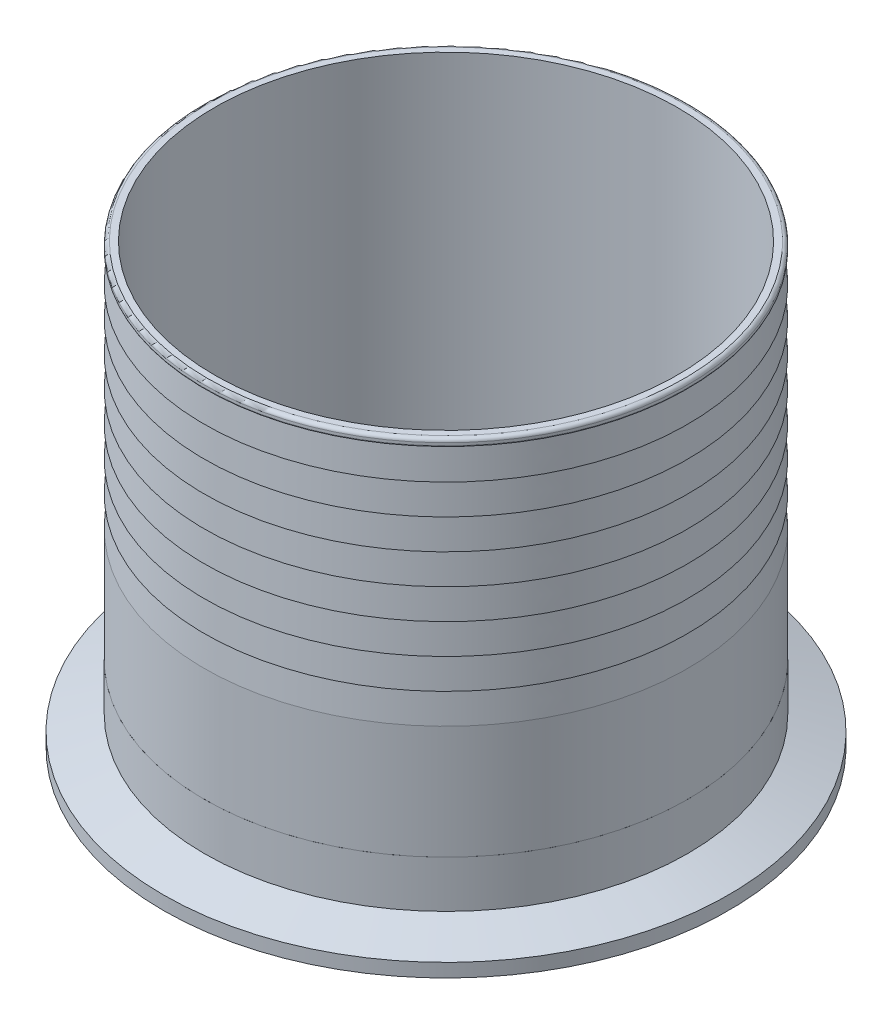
ISO-10303-21;
HEADER;
FILE_DESCRIPTION(('STEP AP214'),'2;1');
FILE_NAME('part.step','',(''),(''),'','','');
FILE_SCHEMA(('AUTOMOTIVE_DESIGN { 1 0 10303 214 1 1 1 1 }'));
ENDSEC;
DATA;
#1=APPLICATION_CONTEXT('core data for automotive mechanical design processes');
#2=APPLICATION_PROTOCOL_DEFINITION('international standard','automotive_design',2000,#1);
#3=PRODUCT_CONTEXT('',#1,'mechanical');
#4=PRODUCT('Part','Part','',(#3));
#5=PRODUCT_RELATED_PRODUCT_CATEGORY('part','',(#4));
#6=PRODUCT_DEFINITION_FORMATION('','',#4);
#7=PRODUCT_DEFINITION_CONTEXT('part definition',#1,'design');
#8=PRODUCT_DEFINITION('design','',#6,#7);
#9=PRODUCT_DEFINITION_SHAPE('','',#8);
#10=(LENGTH_UNIT() NAMED_UNIT(*) SI_UNIT(.MILLI.,.METRE.));
#11=(NAMED_UNIT(*) PLANE_ANGLE_UNIT() SI_UNIT($,.RADIAN.));
#12=(NAMED_UNIT(*) SI_UNIT($,.STERADIAN.) SOLID_ANGLE_UNIT());
#13=UNCERTAINTY_MEASURE_WITH_UNIT(LENGTH_MEASURE(1.E-05),#10,'distance_accuracy_value','');
#14=(GEOMETRIC_REPRESENTATION_CONTEXT(3) GLOBAL_UNCERTAINTY_ASSIGNED_CONTEXT((#13)) GLOBAL_UNIT_ASSIGNED_CONTEXT((#10,
#11,#12)) REPRESENTATION_CONTEXT('',''));
#15=CARTESIAN_POINT('',(0.,0.,0.));
#16=DIRECTION('',(0.,0.,1.));
#17=DIRECTION('',(1.,0.,0.));
#18=AXIS2_PLACEMENT_3D('',#15,#16,#17);
#19=CARTESIAN_POINT('',(31.9768292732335,69.5188429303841,47.1580409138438));
#20=DIRECTION('',(0.,-1.,0.));
#21=DIRECTION('',(-0.956939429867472,0.,0.290287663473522));
#22=AXIS2_PLACEMENT_3D('',#19,#20,#21);
#23=PLANE('',#22);
#24=CARTESIAN_POINT('',(46.7234425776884,69.5188429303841,95.7705639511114));
#25=DIRECTION('',(0.,-1.,0.));
#26=DIRECTION('',(-0.956939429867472,0.,0.290287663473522));
#27=AXIS2_PLACEMENT_3D('',#24,#25,#26);
#28=CIRCLE('',#27,48.6918);
#29=CARTESIAN_POINT('',(0.128339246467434,69.5188429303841,109.905192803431));
#30=VERTEX_POINT('',#29);
#31=EDGE_CURVE('P0_E85',#30,#30,#28,.T.);
#32=ORIENTED_EDGE('',*,*,#31,.F.);
#33=EDGE_LOOP('',(#32));
#34=FACE_BOUND('',#33,.T.);
#35=CARTESIAN_POINT('',(46.7234425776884,69.5188429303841,95.7705639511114));
#36=DIRECTION('',(0.,-1.,0.));
#37=DIRECTION('',(-0.956939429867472,0.,0.290287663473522));
#38=AXIS2_PLACEMENT_3D('',#35,#36,#37);
#39=CIRCLE('',#38,50.8);
#40=CARTESIAN_POINT('',(-1.88908045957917,69.5188429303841,110.517177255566));
#41=VERTEX_POINT('',#40);
#42=EDGE_CURVE('P0_E9',#41,#41,#39,.T.);
#43=ORIENTED_EDGE('',*,*,#42,.T.);
#44=EDGE_LOOP('',(#43));
#45=FACE_BOUND('',#44,.T.);
#46=ADVANCED_FACE('P0_F14',(#34,#45),#23,.T.);
#47=CARTESIAN_POINT('',(46.7234425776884,69.5188429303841,95.7705639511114));
#48=DIRECTION('',(0.,-1.,0.));
#49=DIRECTION('',(-0.956939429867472,0.,0.290287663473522));
#50=AXIS2_PLACEMENT_3D('',#47,#48,#49);
#51=CYLINDRICAL_SURFACE('',#50,50.8);
#52=CARTESIAN_POINT('',(46.7234425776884,93.3440429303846,95.7705639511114));
#53=DIRECTION('',(0.,-1.,0.));
#54=DIRECTION('',(-0.956939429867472,0.,0.290287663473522));
#55=AXIS2_PLACEMENT_3D('',#52,#53,#54);
#56=CIRCLE('',#55,50.8);
#57=CARTESIAN_POINT('',(-1.88908045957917,93.3440429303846,110.517177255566));
#58=VERTEX_POINT('',#57);
#59=EDGE_CURVE('P0_E20',#58,#58,#56,.T.);
#60=ORIENTED_EDGE('',*,*,#59,.T.);
#61=EDGE_LOOP('',(#60));
#62=FACE_BOUND('',#61,.T.);
#63=ORIENTED_EDGE('',*,*,#42,.F.);
#64=EDGE_LOOP('',(#63));
#65=FACE_BOUND('',#64,.T.);
#66=ADVANCED_FACE('P0_F101',(#62,#65),#51,.T.);
#67=CARTESIAN_POINT('',(46.7234425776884,93.3440429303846,95.7705639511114));
#68=DIRECTION('',(0.,-1.,0.));
#69=DIRECTION('',(-0.956939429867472,0.,0.290287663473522));
#70=AXIS2_PLACEMENT_3D('',#67,#68,#69);
#71=CONICAL_SURFACE('',#70,50.8,0.0599281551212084);
#72=CARTESIAN_POINT('',(46.7234425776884,99.6940429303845,95.7705639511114));
#73=DIRECTION('',(0.,-1.,0.));
#74=DIRECTION('',(-0.956939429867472,0.,0.290287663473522));
#75=AXIS2_PLACEMENT_3D('',#72,#73,#74);
#76=CIRCLE('',#75,50.419);
#77=CARTESIAN_POINT('',(-1.52448653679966,99.6940429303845,110.406577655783));
#78=VERTEX_POINT('',#77);
#79=EDGE_CURVE('P0_E24',#78,#78,#76,.T.);
#80=ORIENTED_EDGE('',*,*,#79,.T.);
#81=EDGE_LOOP('',(#80));
#82=FACE_BOUND('',#81,.T.);
#83=ORIENTED_EDGE('',*,*,#59,.F.);
#84=EDGE_LOOP('',(#83));
#85=FACE_BOUND('',#84,.T.);
#86=ADVANCED_FACE('P0_F106',(#82,#85),#71,.T.);
#87=CARTESIAN_POINT('',(31.9768292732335,99.6940429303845,47.1580409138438));
#88=DIRECTION('',(0.,-1.,0.));
#89=DIRECTION('',(-0.956939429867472,0.,0.290287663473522));
#90=AXIS2_PLACEMENT_3D('',#87,#88,#89);
#91=PLANE('',#90);
#92=CARTESIAN_POINT('',(46.7234425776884,99.6940429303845,95.7705639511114));
#93=DIRECTION('',(0.,-1.,0.));
#94=DIRECTION('',(-0.956939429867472,0.,0.290287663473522));
#95=AXIS2_PLACEMENT_3D('',#92,#93,#94);
#96=CIRCLE('',#95,50.8);
#97=CARTESIAN_POINT('',(-1.88908045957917,99.6940429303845,110.517177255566));
#98=VERTEX_POINT('',#97);
#99=EDGE_CURVE('P0_E28',#98,#98,#96,.T.);
#100=ORIENTED_EDGE('',*,*,#99,.T.);
#101=EDGE_LOOP('',(#100));
#102=FACE_BOUND('',#101,.T.);
#103=ORIENTED_EDGE('',*,*,#79,.F.);
#104=EDGE_LOOP('',(#103));
#105=FACE_BOUND('',#104,.T.);
#106=ADVANCED_FACE('P0_F110',(#102,#105),#91,.T.);
#107=CARTESIAN_POINT('',(46.7234425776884,99.6940429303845,95.7705639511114));
#108=DIRECTION('',(0.,-1.,0.));
#109=DIRECTION('',(-0.956939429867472,0.,0.290287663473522));
#110=AXIS2_PLACEMENT_3D('',#107,#108,#109);
#111=CONICAL_SURFACE('',#110,50.8,0.0599281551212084);
#112=CARTESIAN_POINT('',(46.7234425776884,106.044042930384,95.7705639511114));
#113=DIRECTION('',(0.,-1.,0.));
#114=DIRECTION('',(-0.956939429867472,0.,0.290287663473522));
#115=AXIS2_PLACEMENT_3D('',#112,#113,#114);
#116=CIRCLE('',#115,50.419);
#117=CARTESIAN_POINT('',(-1.52448653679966,106.044042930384,110.406577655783));
#118=VERTEX_POINT('',#117);
#119=EDGE_CURVE('P0_E33',#118,#118,#116,.T.);
#120=ORIENTED_EDGE('',*,*,#119,.T.);
#121=EDGE_LOOP('',(#120));
#122=FACE_BOUND('',#121,.T.);
#123=ORIENTED_EDGE('',*,*,#99,.F.);
#124=EDGE_LOOP('',(#123));
#125=FACE_BOUND('',#124,.T.);
#126=ADVANCED_FACE('P0_F117',(#122,#125),#111,.T.);
#127=CARTESIAN_POINT('',(31.9768292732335,106.044042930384,47.1580409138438));
#128=DIRECTION('',(0.,-1.,0.));
#129=DIRECTION('',(-0.956939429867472,0.,0.290287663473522));
#130=AXIS2_PLACEMENT_3D('',#127,#128,#129);
#131=PLANE('',#130);
#132=CARTESIAN_POINT('',(46.7234425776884,106.044042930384,95.7705639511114));
#133=DIRECTION('',(0.,-1.,0.));
#134=DIRECTION('',(-0.956939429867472,0.,0.290287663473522));
#135=AXIS2_PLACEMENT_3D('',#132,#133,#134);
#136=CIRCLE('',#135,50.8);
#137=CARTESIAN_POINT('',(-1.88908045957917,106.044042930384,110.517177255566));
#138=VERTEX_POINT('',#137);
#139=EDGE_CURVE('P0_E36',#138,#138,#136,.T.);
#140=ORIENTED_EDGE('',*,*,#139,.T.);
#141=EDGE_LOOP('',(#140));
#142=FACE_BOUND('',#141,.T.);
#143=ORIENTED_EDGE('',*,*,#119,.F.);
#144=EDGE_LOOP('',(#143));
#145=FACE_BOUND('',#144,.T.);
#146=ADVANCED_FACE('P0_F121',(#142,#145),#131,.T.);
#147=CARTESIAN_POINT('',(46.7234425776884,106.044042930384,95.7705639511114));
#148=DIRECTION('',(0.,-1.,0.));
#149=DIRECTION('',(-0.956939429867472,0.,0.290287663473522));
#150=AXIS2_PLACEMENT_3D('',#147,#148,#149);
#151=CONICAL_SURFACE('',#150,50.8,0.0599281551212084);
#152=CARTESIAN_POINT('',(46.7234425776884,112.394042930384,95.7705639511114));
#153=DIRECTION('',(0.,-1.,0.));
#154=DIRECTION('',(-0.956939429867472,0.,0.290287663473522));
#155=AXIS2_PLACEMENT_3D('',#152,#153,#154);
#156=CIRCLE('',#155,50.419);
#157=CARTESIAN_POINT('',(-1.52448653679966,112.394042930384,110.406577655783));
#158=VERTEX_POINT('',#157);
#159=EDGE_CURVE('P0_E39',#158,#158,#156,.T.);
#160=ORIENTED_EDGE('',*,*,#159,.T.);
#161=EDGE_LOOP('',(#160));
#162=FACE_BOUND('',#161,.T.);
#163=ORIENTED_EDGE('',*,*,#139,.F.);
#164=EDGE_LOOP('',(#163));
#165=FACE_BOUND('',#164,.T.);
#166=ADVANCED_FACE('P0_F125',(#162,#165),#151,.T.);
#167=CARTESIAN_POINT('',(31.9768292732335,112.394042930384,47.1580409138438));
#168=DIRECTION('',(0.,-1.,0.));
#169=DIRECTION('',(-0.956939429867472,0.,0.290287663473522));
#170=AXIS2_PLACEMENT_3D('',#167,#168,#169);
#171=PLANE('',#170);
#172=CARTESIAN_POINT('',(46.7234425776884,112.394042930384,95.7705639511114));
#173=DIRECTION('',(0.,-1.,0.));
#174=DIRECTION('',(-0.956939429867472,0.,0.290287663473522));
#175=AXIS2_PLACEMENT_3D('',#172,#173,#174);
#176=CIRCLE('',#175,50.8);
#177=CARTESIAN_POINT('',(-1.88908045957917,112.394042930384,110.517177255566));
#178=VERTEX_POINT('',#177);
#179=EDGE_CURVE('P0_E42',#178,#178,#176,.T.);
#180=ORIENTED_EDGE('',*,*,#179,.T.);
#181=EDGE_LOOP('',(#180));
#182=FACE_BOUND('',#181,.T.);
#183=ORIENTED_EDGE('',*,*,#159,.F.);
#184=EDGE_LOOP('',(#183));
#185=FACE_BOUND('',#184,.T.);
#186=ADVANCED_FACE('P0_F129',(#182,#185),#171,.T.);
#187=CARTESIAN_POINT('',(46.7234425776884,112.394042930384,95.7705639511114));
#188=DIRECTION('',(0.,-1.,0.));
#189=DIRECTION('',(-0.956939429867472,0.,0.290287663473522));
#190=AXIS2_PLACEMENT_3D('',#187,#188,#189);
#191=CONICAL_SURFACE('',#190,50.8,0.0599281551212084);
#192=CARTESIAN_POINT('',(46.7234425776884,118.744042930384,95.7705639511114));
#193=DIRECTION('',(0.,-1.,0.));
#194=DIRECTION('',(-0.956939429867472,0.,0.290287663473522));
#195=AXIS2_PLACEMENT_3D('',#192,#193,#194);
#196=CIRCLE('',#195,50.419);
#197=CARTESIAN_POINT('',(-1.52448653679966,118.744042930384,110.406577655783));
#198=VERTEX_POINT('',#197);
#199=EDGE_CURVE('P0_E45',#198,#198,#196,.T.);
#200=ORIENTED_EDGE('',*,*,#199,.T.);
#201=EDGE_LOOP('',(#200));
#202=FACE_BOUND('',#201,.T.);
#203=ORIENTED_EDGE('',*,*,#179,.F.);
#204=EDGE_LOOP('',(#203));
#205=FACE_BOUND('',#204,.T.);
#206=ADVANCED_FACE('P0_F133',(#202,#205),#191,.T.);
#207=CARTESIAN_POINT('',(31.9768292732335,118.744042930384,47.1580409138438));
#208=DIRECTION('',(0.,-1.,0.));
#209=DIRECTION('',(-0.956939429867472,0.,0.290287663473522));
#210=AXIS2_PLACEMENT_3D('',#207,#208,#209);
#211=PLANE('',#210);
#212=CARTESIAN_POINT('',(46.7234425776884,118.744042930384,95.7705639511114));
#213=DIRECTION('',(0.,-1.,0.));
#214=DIRECTION('',(-0.956939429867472,0.,0.290287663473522));
#215=AXIS2_PLACEMENT_3D('',#212,#213,#214);
#216=CIRCLE('',#215,50.8);
#217=CARTESIAN_POINT('',(-1.88908045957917,118.744042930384,110.517177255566));
#218=VERTEX_POINT('',#217);
#219=EDGE_CURVE('P0_E48',#218,#218,#216,.T.);
#220=ORIENTED_EDGE('',*,*,#219,.T.);
#221=EDGE_LOOP('',(#220));
#222=FACE_BOUND('',#221,.T.);
#223=ORIENTED_EDGE('',*,*,#199,.F.);
#224=EDGE_LOOP('',(#223));
#225=FACE_BOUND('',#224,.T.);
#226=ADVANCED_FACE('P0_F137',(#222,#225),#211,.T.);
#227=CARTESIAN_POINT('',(46.7234425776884,118.744042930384,95.7705639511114));
#228=DIRECTION('',(0.,-1.,0.));
#229=DIRECTION('',(-0.956939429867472,0.,0.290287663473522));
#230=AXIS2_PLACEMENT_3D('',#227,#228,#229);
#231=CONICAL_SURFACE('',#230,50.8,0.0599281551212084);
#232=CARTESIAN_POINT('',(46.7234425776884,125.094042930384,95.7705639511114));
#233=DIRECTION('',(0.,-1.,0.));
#234=DIRECTION('',(-0.956939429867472,0.,0.290287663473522));
#235=AXIS2_PLACEMENT_3D('',#232,#233,#234);
#236=CIRCLE('',#235,50.419);
#237=CARTESIAN_POINT('',(-1.52448653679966,125.094042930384,110.406577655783));
#238=VERTEX_POINT('',#237);
#239=EDGE_CURVE('P0_E51',#238,#238,#236,.T.);
#240=ORIENTED_EDGE('',*,*,#239,.T.);
#241=EDGE_LOOP('',(#240));
#242=FACE_BOUND('',#241,.T.);
#243=ORIENTED_EDGE('',*,*,#219,.F.);
#244=EDGE_LOOP('',(#243));
#245=FACE_BOUND('',#244,.T.);
#246=ADVANCED_FACE('P0_F141',(#242,#245),#231,.T.);
#247=CARTESIAN_POINT('',(31.9768292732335,125.094042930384,47.1580409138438));
#248=DIRECTION('',(0.,-1.,0.));
#249=DIRECTION('',(-0.956939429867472,0.,0.290287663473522));
#250=AXIS2_PLACEMENT_3D('',#247,#248,#249);
#251=PLANE('',#250);
#252=CARTESIAN_POINT('',(46.7234425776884,125.094042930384,95.7705639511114));
#253=DIRECTION('',(0.,-1.,0.));
#254=DIRECTION('',(-0.956939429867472,0.,0.290287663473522));
#255=AXIS2_PLACEMENT_3D('',#252,#253,#254);
#256=CIRCLE('',#255,50.8);
#257=CARTESIAN_POINT('',(-1.88908045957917,125.094042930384,110.517177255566));
#258=VERTEX_POINT('',#257);
#259=EDGE_CURVE('P0_E54',#258,#258,#256,.T.);
#260=ORIENTED_EDGE('',*,*,#259,.T.);
#261=EDGE_LOOP('',(#260));
#262=FACE_BOUND('',#261,.T.);
#263=ORIENTED_EDGE('',*,*,#239,.F.);
#264=EDGE_LOOP('',(#263));
#265=FACE_BOUND('',#264,.T.);
#266=ADVANCED_FACE('P0_F145',(#262,#265),#251,.T.);
#267=CARTESIAN_POINT('',(46.7234425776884,125.094042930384,95.7705639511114));
#268=DIRECTION('',(0.,-1.,0.));
#269=DIRECTION('',(-0.956939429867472,0.,0.290287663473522));
#270=AXIS2_PLACEMENT_3D('',#267,#268,#269);
#271=CONICAL_SURFACE('',#270,50.8,0.0599281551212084);
#272=CARTESIAN_POINT('',(46.7234425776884,131.444042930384,95.7705639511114));
#273=DIRECTION('',(0.,-1.,0.));
#274=DIRECTION('',(-0.956939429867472,0.,0.290287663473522));
#275=AXIS2_PLACEMENT_3D('',#272,#273,#274);
#276=CIRCLE('',#275,50.419);
#277=CARTESIAN_POINT('',(-1.52448653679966,131.444042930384,110.406577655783));
#278=VERTEX_POINT('',#277);
#279=EDGE_CURVE('P0_E57',#278,#278,#276,.T.);
#280=ORIENTED_EDGE('',*,*,#279,.T.);
#281=EDGE_LOOP('',(#280));
#282=FACE_BOUND('',#281,.T.);
#283=ORIENTED_EDGE('',*,*,#259,.F.);
#284=EDGE_LOOP('',(#283));
#285=FACE_BOUND('',#284,.T.);
#286=ADVANCED_FACE('P0_F149',(#282,#285),#271,.T.);
#287=CARTESIAN_POINT('',(31.9768292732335,131.444042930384,47.1580409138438));
#288=DIRECTION('',(0.,-1.,0.));
#289=DIRECTION('',(-0.956939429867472,0.,0.290287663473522));
#290=AXIS2_PLACEMENT_3D('',#287,#288,#289);
#291=PLANE('',#290);
#292=CARTESIAN_POINT('',(46.7234425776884,131.444042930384,95.7705639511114));
#293=DIRECTION('',(0.,-1.,0.));
#294=DIRECTION('',(-0.956939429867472,0.,0.290287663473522));
#295=AXIS2_PLACEMENT_3D('',#292,#293,#294);
#296=CIRCLE('',#295,50.8);
#297=CARTESIAN_POINT('',(-1.88908045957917,131.444042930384,110.517177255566));
#298=VERTEX_POINT('',#297);
#299=EDGE_CURVE('P0_E60',#298,#298,#296,.T.);
#300=ORIENTED_EDGE('',*,*,#299,.T.);
#301=EDGE_LOOP('',(#300));
#302=FACE_BOUND('',#301,.T.);
#303=ORIENTED_EDGE('',*,*,#279,.F.);
#304=EDGE_LOOP('',(#303));
#305=FACE_BOUND('',#304,.T.);
#306=ADVANCED_FACE('P0_F153',(#302,#305),#291,.T.);
#307=CARTESIAN_POINT('',(46.7234425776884,131.444042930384,95.7705639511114));
#308=DIRECTION('',(0.,-1.,0.));
#309=DIRECTION('',(-0.956939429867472,0.,0.290287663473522));
#310=AXIS2_PLACEMENT_3D('',#307,#308,#309);
#311=CONICAL_SURFACE('',#310,50.8,0.0599281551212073);
#312=CARTESIAN_POINT('',(46.7234425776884,137.794042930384,95.7705639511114));
#313=DIRECTION('',(0.,-1.,0.));
#314=DIRECTION('',(-0.956939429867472,0.,0.290287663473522));
#315=AXIS2_PLACEMENT_3D('',#312,#313,#314);
#316=CIRCLE('',#315,50.419);
#317=CARTESIAN_POINT('',(-1.52448653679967,137.794042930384,110.406577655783));
#318=VERTEX_POINT('',#317);
#319=EDGE_CURVE('P0_E63',#318,#318,#316,.T.);
#320=ORIENTED_EDGE('',*,*,#319,.T.);
#321=EDGE_LOOP('',(#320));
#322=FACE_BOUND('',#321,.T.);
#323=ORIENTED_EDGE('',*,*,#299,.F.);
#324=EDGE_LOOP('',(#323));
#325=FACE_BOUND('',#324,.T.);
#326=ADVANCED_FACE('P0_F157',(#322,#325),#311,.T.);
#327=CARTESIAN_POINT('',(31.9768292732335,137.794042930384,47.1580409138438));
#328=DIRECTION('',(0.,-1.,0.));
#329=DIRECTION('',(-0.956939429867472,0.,0.290287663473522));
#330=AXIS2_PLACEMENT_3D('',#327,#328,#329);
#331=PLANE('',#330);
#332=CARTESIAN_POINT('',(46.7234425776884,137.794042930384,95.7705639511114));
#333=DIRECTION('',(0.,-1.,0.));
#334=DIRECTION('',(-0.956939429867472,0.,0.290287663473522));
#335=AXIS2_PLACEMENT_3D('',#332,#333,#334);
#336=CIRCLE('',#335,50.8);
#337=CARTESIAN_POINT('',(-1.88908045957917,137.794042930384,110.517177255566));
#338=VERTEX_POINT('',#337);
#339=EDGE_CURVE('P0_E66',#338,#338,#336,.T.);
#340=ORIENTED_EDGE('',*,*,#339,.T.);
#341=EDGE_LOOP('',(#340));
#342=FACE_BOUND('',#341,.T.);
#343=ORIENTED_EDGE('',*,*,#319,.F.);
#344=EDGE_LOOP('',(#343));
#345=FACE_BOUND('',#344,.T.);
#346=ADVANCED_FACE('P0_F161',(#342,#345),#331,.T.);
#347=CARTESIAN_POINT('',(46.7234425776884,137.794042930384,95.7705639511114));
#348=DIRECTION('',(0.,-1.,0.));
#349=DIRECTION('',(-0.956939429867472,0.,0.290287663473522));
#350=AXIS2_PLACEMENT_3D('',#347,#348,#349);
#351=CONICAL_SURFACE('',#350,50.8,0.0599281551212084);
#352=CARTESIAN_POINT('',(46.7234425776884,144.144042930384,95.7705639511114));
#353=DIRECTION('',(0.,-1.,0.));
#354=DIRECTION('',(-0.956939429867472,0.,0.290287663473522));
#355=AXIS2_PLACEMENT_3D('',#352,#353,#354);
#356=CIRCLE('',#355,50.419);
#357=CARTESIAN_POINT('',(-1.52448653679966,144.144042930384,110.406577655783));
#358=VERTEX_POINT('',#357);
#359=EDGE_CURVE('P0_E69',#358,#358,#356,.T.);
#360=ORIENTED_EDGE('',*,*,#359,.T.);
#361=EDGE_LOOP('',(#360));
#362=FACE_BOUND('',#361,.T.);
#363=ORIENTED_EDGE('',*,*,#339,.F.);
#364=EDGE_LOOP('',(#363));
#365=FACE_BOUND('',#364,.T.);
#366=ADVANCED_FACE('P0_F165',(#362,#365),#351,.T.);
#367=CARTESIAN_POINT('',(32.0505623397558,144.144042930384,47.40110352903));
#368=DIRECTION('',(0.,-1.,0.));
#369=DIRECTION('',(-0.956939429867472,0.,0.290287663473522));
#370=AXIS2_PLACEMENT_3D('',#367,#368,#369);
#371=PLANE('',#370);
#372=CARTESIAN_POINT('',(46.7234425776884,144.144042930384,95.7705639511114));
#373=DIRECTION('',(0.,-1.,0.));
#374=DIRECTION('',(-0.956939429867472,0.,0.290287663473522));
#375=AXIS2_PLACEMENT_3D('',#372,#373,#374);
#376=CIRCLE('',#375,50.5460000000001);
#377=CARTESIAN_POINT('',(-1.64601784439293,144.144042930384,110.443444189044));
#378=VERTEX_POINT('',#377);
#379=EDGE_CURVE('P0_E72',#378,#378,#376,.T.);
#380=ORIENTED_EDGE('',*,*,#379,.T.);
#381=EDGE_LOOP('',(#380));
#382=FACE_BOUND('',#381,.T.);
#383=ORIENTED_EDGE('',*,*,#359,.F.);
#384=EDGE_LOOP('',(#383));
#385=FACE_BOUND('',#384,.T.);
#386=ADVANCED_FACE('P0_F169',(#382,#385),#371,.T.);
#387=CARTESIAN_POINT('',(46.7234425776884,144.398042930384,95.7705639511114));
#388=DIRECTION('',(0.,-1.,0.));
#389=DIRECTION('',(-0.956939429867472,0.,0.290287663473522));
#390=AXIS2_PLACEMENT_3D('',#387,#388,#389);
#391=TOROIDAL_SURFACE('',#390,50.546,0.25400000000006);
#392=CARTESIAN_POINT('',(46.7234425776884,144.398042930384,95.7705639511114));
#393=DIRECTION('',(0.,-1.,0.));
#394=DIRECTION('',(-0.956939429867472,0.,0.290287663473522));
#395=AXIS2_PLACEMENT_3D('',#392,#393,#394);
#396=CIRCLE('',#395,50.8);
#397=CARTESIAN_POINT('',(-1.88908045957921,144.398042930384,110.517177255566));
#398=VERTEX_POINT('',#397);
#399=EDGE_CURVE('P0_E75',#398,#398,#396,.T.);
#400=ORIENTED_EDGE('',*,*,#399,.T.);
#401=EDGE_LOOP('',(#400));
#402=FACE_BOUND('',#401,.T.);
#403=ORIENTED_EDGE('',*,*,#379,.F.);
#404=EDGE_LOOP('',(#403));
#405=FACE_BOUND('',#404,.T.);
#406=ADVANCED_FACE('P0_F173',(#402,#405),#391,.T.);
#407=CARTESIAN_POINT('',(46.7234425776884,69.5188429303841,95.7705639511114));
#408=DIRECTION('',(0.,-1.,0.));
#409=DIRECTION('',(-0.956939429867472,0.,0.290287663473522));
#410=AXIS2_PLACEMENT_3D('',#407,#408,#409);
#411=CYLINDRICAL_SURFACE('',#410,50.8);
#412=CARTESIAN_POINT('',(46.7234425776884,144.956842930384,95.7705639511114));
#413=DIRECTION('',(0.,-1.,0.));
#414=DIRECTION('',(-0.956939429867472,0.,0.290287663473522));
#415=AXIS2_PLACEMENT_3D('',#412,#413,#414);
#416=CIRCLE('',#415,50.8);
#417=CARTESIAN_POINT('',(-1.88908045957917,144.956842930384,110.517177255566));
#418=VERTEX_POINT('',#417);
#419=EDGE_CURVE('P0_E78',#418,#418,#416,.T.);
#420=ORIENTED_EDGE('',*,*,#419,.T.);
#421=EDGE_LOOP('',(#420));
#422=FACE_BOUND('',#421,.T.);
#423=ORIENTED_EDGE('',*,*,#399,.F.);
#424=EDGE_LOOP('',(#423));
#425=FACE_BOUND('',#424,.T.);
#426=ADVANCED_FACE('P0_F177',(#422,#425),#411,.T.);
#427=CARTESIAN_POINT('',(46.7234425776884,144.956842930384,95.7705639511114));
#428=DIRECTION('',(0.,-1.,0.));
#429=DIRECTION('',(-0.956939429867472,0.,0.290287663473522));
#430=AXIS2_PLACEMENT_3D('',#427,#428,#429);
#431=TOROIDAL_SURFACE('',#430,50.038,0.762000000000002);
#432=CARTESIAN_POINT('',(46.7234425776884,145.718842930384,95.7705639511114));
#433=DIRECTION('',(0.,-1.,0.));
#434=DIRECTION('',(-0.956939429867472,0.,0.290287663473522));
#435=AXIS2_PLACEMENT_3D('',#432,#433,#434);
#436=CIRCLE('',#435,50.038);
#437=CARTESIAN_POINT('',(-1.15989261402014,145.718842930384,110.295978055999));
#438=VERTEX_POINT('',#437);
#439=EDGE_CURVE('P0_E81',#438,#438,#436,.T.);
#440=ORIENTED_EDGE('',*,*,#439,.T.);
#441=EDGE_LOOP('',(#440));
#442=FACE_BOUND('',#441,.T.);
#443=ORIENTED_EDGE('',*,*,#419,.F.);
#444=EDGE_LOOP('',(#443));
#445=FACE_BOUND('',#444,.T.);
#446=ADVANCED_FACE('P0_F181',(#442,#445),#431,.T.);
#447=CARTESIAN_POINT('',(46.7234425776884,145.718842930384,95.7705639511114));
#448=DIRECTION('',(0.,1.,0.));
#449=DIRECTION('',(0.956939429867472,0.,-0.290287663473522));
#450=AXIS2_PLACEMENT_3D('',#447,#448,#449);
#451=PLANE('',#450);
#452=CARTESIAN_POINT('',(46.7234425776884,145.718842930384,95.7705639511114));
#453=DIRECTION('',(0.,-1.,0.));
#454=DIRECTION('',(-0.956939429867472,0.,0.290287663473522));
#455=AXIS2_PLACEMENT_3D('',#452,#453,#454);
#456=CIRCLE('',#455,48.6918);
#457=CARTESIAN_POINT('',(0.128339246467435,145.718842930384,109.905192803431));
#458=VERTEX_POINT('',#457);
#459=EDGE_CURVE('P0_E84',#458,#458,#456,.T.);
#460=ORIENTED_EDGE('',*,*,#459,.T.);
#461=EDGE_LOOP('',(#460));
#462=FACE_BOUND('',#461,.T.);
#463=ORIENTED_EDGE('',*,*,#439,.F.);
#464=EDGE_LOOP('',(#463));
#465=FACE_BOUND('',#464,.T.);
#466=ADVANCED_FACE('P0_F91',(#462,#465),#451,.T.);
#467=CARTESIAN_POINT('',(46.7234425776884,145.718842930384,95.7705639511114));
#468=DIRECTION('',(0.,-1.,0.));
#469=DIRECTION('',(-0.956939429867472,0.,0.290287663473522));
#470=AXIS2_PLACEMENT_3D('',#467,#468,#469);
#471=CYLINDRICAL_SURFACE('',#470,48.6918);
#472=CARTESIAN_POINT('',(0.128339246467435,145.718842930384,109.905192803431));
#473=CARTESIAN_POINT('',(0.128339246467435,144.925092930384,109.905192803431));
#474=CARTESIAN_POINT('',(0.128339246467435,144.131342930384,109.905192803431));
#475=CARTESIAN_POINT('',(0.128339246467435,142.543842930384,109.905192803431));
#476=CARTESIAN_POINT('',(0.128339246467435,141.750092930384,109.905192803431));
#477=CARTESIAN_POINT('',(0.128339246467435,140.162592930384,109.905192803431));
#478=CARTESIAN_POINT('',(0.128339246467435,139.368842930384,109.905192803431));
#479=CARTESIAN_POINT('',(0.128339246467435,137.781342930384,109.905192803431));
#480=CARTESIAN_POINT('',(0.128339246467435,136.987592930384,109.905192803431));
#481=CARTESIAN_POINT('',(0.128339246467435,135.400092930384,109.905192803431));
#482=CARTESIAN_POINT('',(0.128339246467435,134.606342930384,109.905192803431));
#483=CARTESIAN_POINT('',(0.128339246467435,133.018842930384,109.905192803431));
#484=CARTESIAN_POINT('',(0.128339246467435,132.225092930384,109.905192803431));
#485=CARTESIAN_POINT('',(0.128339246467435,130.637592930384,109.905192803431));
#486=CARTESIAN_POINT('',(0.128339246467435,129.843842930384,109.905192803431));
#487=CARTESIAN_POINT('',(0.128339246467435,128.256342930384,109.905192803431));
#488=CARTESIAN_POINT('',(0.128339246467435,127.462592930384,109.905192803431));
#489=CARTESIAN_POINT('',(0.128339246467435,125.875092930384,109.905192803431));
#490=CARTESIAN_POINT('',(0.128339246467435,125.081342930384,109.905192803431));
#491=CARTESIAN_POINT('',(0.128339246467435,123.493842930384,109.905192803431));
#492=CARTESIAN_POINT('',(0.128339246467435,122.700092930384,109.905192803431));
#493=CARTESIAN_POINT('',(0.128339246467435,121.112592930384,109.905192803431));
#494=CARTESIAN_POINT('',(0.128339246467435,120.318842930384,109.905192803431));
#495=CARTESIAN_POINT('',(0.128339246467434,118.731342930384,109.905192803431));
#496=CARTESIAN_POINT('',(0.128339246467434,117.937592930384,109.905192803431));
#497=CARTESIAN_POINT('',(0.128339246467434,116.350092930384,109.905192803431));
#498=CARTESIAN_POINT('',(0.128339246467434,115.556342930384,109.905192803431));
#499=CARTESIAN_POINT('',(0.128339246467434,113.968842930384,109.905192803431));
#500=CARTESIAN_POINT('',(0.128339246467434,113.175092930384,109.905192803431));
#501=CARTESIAN_POINT('',(0.128339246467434,111.587592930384,109.905192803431));
#502=CARTESIAN_POINT('',(0.128339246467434,110.793842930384,109.905192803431));
#503=CARTESIAN_POINT('',(0.128339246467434,109.206342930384,109.905192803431));
#504=CARTESIAN_POINT('',(0.128339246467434,108.412592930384,109.905192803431));
#505=CARTESIAN_POINT('',(0.128339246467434,106.825092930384,109.905192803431));
#506=CARTESIAN_POINT('',(0.128339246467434,106.031342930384,109.905192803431));
#507=CARTESIAN_POINT('',(0.128339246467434,104.443842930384,109.905192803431));
#508=CARTESIAN_POINT('',(0.128339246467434,103.650092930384,109.905192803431));
#509=CARTESIAN_POINT('',(0.128339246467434,102.062592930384,109.905192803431));
#510=CARTESIAN_POINT('',(0.128339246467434,101.268842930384,109.905192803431));
#511=CARTESIAN_POINT('',(0.128339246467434,99.6813429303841,109.905192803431));
#512=CARTESIAN_POINT('',(0.128339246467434,98.8875929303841,109.905192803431));
#513=CARTESIAN_POINT('',(0.128339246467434,97.3000929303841,109.905192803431));
#514=CARTESIAN_POINT('',(0.128339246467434,96.5063429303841,109.905192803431));
#515=CARTESIAN_POINT('',(0.128339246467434,94.9188429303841,109.905192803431));
#516=CARTESIAN_POINT('',(0.128339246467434,94.1250929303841,109.905192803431));
#517=CARTESIAN_POINT('',(0.128339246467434,92.5375929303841,109.905192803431));
#518=CARTESIAN_POINT('',(0.128339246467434,91.7438429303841,109.905192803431));
#519=CARTESIAN_POINT('',(0.128339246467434,90.1563429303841,109.905192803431));
#520=CARTESIAN_POINT('',(0.128339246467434,89.3625929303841,109.905192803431));
#521=CARTESIAN_POINT('',(0.128339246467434,87.7750929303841,109.905192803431));
#522=CARTESIAN_POINT('',(0.128339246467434,86.9813429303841,109.905192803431));
#523=CARTESIAN_POINT('',(0.128339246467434,85.3938429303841,109.905192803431));
#524=CARTESIAN_POINT('',(0.128339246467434,84.6000929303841,109.905192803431));
#525=CARTESIAN_POINT('',(0.128339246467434,83.0125929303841,109.905192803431));
#526=CARTESIAN_POINT('',(0.128339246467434,82.2188429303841,109.905192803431));
#527=CARTESIAN_POINT('',(0.128339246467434,80.6313429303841,109.905192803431));
#528=CARTESIAN_POINT('',(0.128339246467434,79.8375929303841,109.905192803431));
#529=CARTESIAN_POINT('',(0.128339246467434,78.2500929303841,109.905192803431));
#530=CARTESIAN_POINT('',(0.128339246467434,77.4563429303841,109.905192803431));
#531=CARTESIAN_POINT('',(0.128339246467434,75.8688429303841,109.905192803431));
#532=CARTESIAN_POINT('',(0.128339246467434,75.0750929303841,109.905192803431));
#533=CARTESIAN_POINT('',(0.128339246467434,73.4875929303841,109.905192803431));
#534=CARTESIAN_POINT('',(0.128339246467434,72.6938429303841,109.905192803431));
#535=CARTESIAN_POINT('',(0.128339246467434,71.1063429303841,109.905192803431));
#536=CARTESIAN_POINT('',(0.128339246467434,70.3125929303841,109.905192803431));
#537=CARTESIAN_POINT('',(0.128339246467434,69.5188429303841,109.905192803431));
#538=B_SPLINE_CURVE_WITH_KNOTS('',3,(#472,#473,#474,#475,#476,#477,#478,#479,#480,#481,#482,
#483,#484,#485,#486,#487,#488,#489,#490,#491,#492,#493,#494,#495,#496,#497,#498,#499,#500,#501,
#502,#503,#504,#505,#506,#507,#508,#509,#510,#511,#512,#513,#514,#515,#516,#517,#518,#519,#520,
#521,#522,#523,#524,#525,#526,#527,#528,#529,#530,#531,#532,#533,#534,#535,#536,#537),
.UNSPECIFIED.,.F.,.F.,(4,2,2,2,2,2,2,2,2,2,2,2,2,2,2,2,2,2,2,2,2,2,2,2,2,2,2,2,2,2,2,2,4),(0.,
2.38124999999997,4.76249999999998,7.14374999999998,9.52499999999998,11.90625,14.2875,16.66875,
19.05,21.43125,23.8125,26.19375,28.575,30.95625,33.3375,35.71875,38.1,40.48125,42.8625,45.24375,
47.625,50.00625,52.3875,54.76875,57.15,59.53125,61.9125,64.29375,66.675,69.05625,71.4375,
73.81875,76.2),.UNSPECIFIED.);
#539=EDGE_CURVE('P0_BSEAM94',#458,#30,#538,.T.);
#540=ORIENTED_EDGE('',*,*,#459,.F.);
#541=ORIENTED_EDGE('',*,*,#31,.T.);
#542=ORIENTED_EDGE('',*,*,#539,.T.);
#543=ORIENTED_EDGE('',*,*,#539,.F.);
#544=EDGE_LOOP('',(#540,#542,#541,#543));
#545=FACE_BOUND('',#544,.T.);
#546=ADVANCED_FACE('P0_F94',(#545),#471,.F.);
#547=CLOSED_SHELL('',(#46,#66,#86,#106,#126,#146,#166,#186,#206,#226,#246,#266,#286,#306,#326,
#346,#366,#386,#406,#426,#446,#466,#546));
#548=MANIFOLD_SOLID_BREP('P0_B1',#547);
#549=CARTESIAN_POINT('',(46.7234425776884,54.4312429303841,95.7705639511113));
#550=DIRECTION('',(0.,-1.,0.));
#551=DIRECTION('',(0.,0.,-1.));
#552=AXIS2_PLACEMENT_3D('',#549,#550,#551);
#553=TOROIDAL_SURFACE('',#552,56.6185084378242,0.787400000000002);
#554=CARTESIAN_POINT('',(46.7234425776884,53.6438429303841,95.7705639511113));
#555=DIRECTION('',(0.,-1.,0.));
#556=DIRECTION('',(0.,0.,-1.));
#557=AXIS2_PLACEMENT_3D('',#554,#555,#556);
#558=CIRCLE('',#557,56.6185084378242);
#559=CARTESIAN_POINT('',(46.7234425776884,53.6438429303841,39.1520555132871));
#560=VERTEX_POINT('',#559);
#561=EDGE_CURVE('P1_E49',#560,#560,#558,.T.);
#562=ORIENTED_EDGE('',*,*,#561,.T.);
#563=EDGE_LOOP('',(#562));
#564=FACE_BOUND('',#563,.T.);
#565=CARTESIAN_POINT('',(46.7234425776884,54.1183019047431,95.7705639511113));
#566=DIRECTION('',(0.,-1.,0.));
#567=DIRECTION('',(0.,0.,-1.));
#568=AXIS2_PLACEMENT_3D('',#565,#566,#567);
#569=CIRCLE('',#568,55.8959666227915);
#570=CARTESIAN_POINT('',(46.7234425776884,54.1183019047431,39.8745973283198));
#571=VERTEX_POINT('',#570);
#572=EDGE_CURVE('P1_E10',#571,#571,#569,.T.);
#573=ORIENTED_EDGE('',*,*,#572,.F.);
#574=EDGE_LOOP('',(#573));
#575=FACE_BOUND('',#574,.T.);
#576=ADVANCED_FACE('P1_F15',(#564,#575),#553,.T.);
#577=CARTESIAN_POINT('',(46.7234425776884,53.6438429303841,95.7705639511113));
#578=DIRECTION('',(0.,-1.,0.));
#579=DIRECTION('',(0.,0.,-1.));
#580=AXIS2_PLACEMENT_3D('',#577,#578,#579);
#581=TOROIDAL_SURFACE('',#580,54.8005,1.1938);
#582=CARTESIAN_POINT('',(46.7234425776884,54.1183019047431,95.7705639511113));
#583=DIRECTION('',(0.,-1.,0.));
#584=DIRECTION('',(0.,0.,-1.));
#585=AXIS2_PLACEMENT_3D('',#582,#583,#584);
#586=CIRCLE('',#585,53.7050333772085);
#587=CARTESIAN_POINT('',(46.7234425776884,54.1183019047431,42.0655305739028));
#588=VERTEX_POINT('',#587);
#589=EDGE_CURVE('P1_E21',#588,#588,#586,.T.);
#590=ORIENTED_EDGE('',*,*,#589,.F.);
#591=EDGE_LOOP('',(#590));
#592=FACE_BOUND('',#591,.T.);
#593=ORIENTED_EDGE('',*,*,#572,.T.);
#594=EDGE_LOOP('',(#593));
#595=FACE_BOUND('',#594,.T.);
#596=ADVANCED_FACE('P1_F98',(#592,#595),#581,.F.);
#597=CARTESIAN_POINT('',(46.7234425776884,54.4312429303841,95.7705639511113));
#598=DIRECTION('',(0.,-1.,0.));
#599=DIRECTION('',(0.,0.,-1.));
#600=AXIS2_PLACEMENT_3D('',#597,#598,#599);
#601=TOROIDAL_SURFACE('',#600,52.9824915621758,0.787399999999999);
#602=ORIENTED_EDGE('',*,*,#589,.T.);
#603=EDGE_LOOP('',(#602));
#604=FACE_BOUND('',#603,.T.);
#605=CARTESIAN_POINT('',(46.7234425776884,53.6438429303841,95.7705639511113));
#606=DIRECTION('',(0.,-1.,0.));
#607=DIRECTION('',(0.,0.,-1.));
#608=AXIS2_PLACEMENT_3D('',#605,#606,#607);
#609=CIRCLE('',#608,52.9824915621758);
#610=CARTESIAN_POINT('',(46.7234425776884,53.6438429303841,42.7880723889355));
#611=VERTEX_POINT('',#610);
#612=EDGE_CURVE('P1_E25',#611,#611,#609,.T.);
#613=ORIENTED_EDGE('',*,*,#612,.F.);
#614=EDGE_LOOP('',(#613));
#615=FACE_BOUND('',#614,.T.);
#616=ADVANCED_FACE('P1_F94',(#604,#615),#601,.T.);
#617=CARTESIAN_POINT('',(46.7234425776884,53.6438429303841,95.7705639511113));
#618=DIRECTION('',(0.,1.,0.));
#619=DIRECTION('',(0.,0.,1.));
#620=AXIS2_PLACEMENT_3D('',#617,#618,#619);
#621=PLANE('',#620);
#622=CARTESIAN_POINT('',(46.7234425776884,53.6438429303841,95.7705639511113));
#623=DIRECTION('',(0.,-1.,0.));
#624=DIRECTION('',(0.,0.,-1.));
#625=AXIS2_PLACEMENT_3D('',#622,#623,#624);
#626=CIRCLE('',#625,48.6918);
#627=CARTESIAN_POINT('',(46.7234425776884,53.6438429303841,47.0787639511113));
#628=VERTEX_POINT('',#627);
#629=EDGE_CURVE('P1_E29',#628,#628,#626,.T.);
#630=ORIENTED_EDGE('',*,*,#629,.F.);
#631=EDGE_LOOP('',(#630));
#632=FACE_BOUND('',#631,.T.);
#633=ORIENTED_EDGE('',*,*,#612,.T.);
#634=EDGE_LOOP('',(#633));
#635=FACE_BOUND('',#634,.T.);
#636=ADVANCED_FACE('P1_F87',(#632,#635),#621,.F.);
#637=CARTESIAN_POINT('',(46.7234425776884,53.6438429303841,95.7705639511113));
#638=DIRECTION('',(0.,-1.,0.));
#639=DIRECTION('',(0.,0.,-1.));
#640=AXIS2_PLACEMENT_3D('',#637,#638,#639);
#641=CYLINDRICAL_SURFACE('',#640,48.6918);
#642=ORIENTED_EDGE('',*,*,#629,.T.);
#643=EDGE_LOOP('',(#642));
#644=FACE_BOUND('',#643,.T.);
#645=CARTESIAN_POINT('',(46.7234425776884,69.5188429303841,95.7705639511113));
#646=DIRECTION('',(0.,-1.,0.));
#647=DIRECTION('',(0.,0.,-1.));
#648=AXIS2_PLACEMENT_3D('',#645,#646,#647);
#649=CIRCLE('',#648,48.6918);
#650=CARTESIAN_POINT('',(46.7234425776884,69.5188429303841,47.0787639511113));
#651=VERTEX_POINT('',#650);
#652=EDGE_CURVE('P1_E34',#651,#651,#649,.T.);
#653=ORIENTED_EDGE('',*,*,#652,.F.);
#654=EDGE_LOOP('',(#653));
#655=FACE_BOUND('',#654,.T.);
#656=ADVANCED_FACE('P1_F82',(#644,#655),#641,.F.);
#657=CARTESIAN_POINT('',(46.7234425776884,69.5188429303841,95.7705639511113));
#658=DIRECTION('',(0.,-1.,0.));
#659=DIRECTION('',(0.,0.,-1.));
#660=AXIS2_PLACEMENT_3D('',#657,#658,#659);
#661=PLANE('',#660);
#662=CARTESIAN_POINT('',(46.7234425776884,69.5188429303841,95.7705639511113));
#663=DIRECTION('',(0.,-1.,0.));
#664=DIRECTION('',(0.,0.,-1.));
#665=AXIS2_PLACEMENT_3D('',#662,#663,#664);
#666=CIRCLE('',#665,50.8);
#667=CARTESIAN_POINT('',(46.7234425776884,69.5188429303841,44.9705639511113));
#668=VERTEX_POINT('',#667);
#669=EDGE_CURVE('P1_E37',#668,#668,#666,.T.);
#670=ORIENTED_EDGE('',*,*,#669,.F.);
#671=EDGE_LOOP('',(#670));
#672=FACE_BOUND('',#671,.T.);
#673=ORIENTED_EDGE('',*,*,#652,.T.);
#674=EDGE_LOOP('',(#673));
#675=FACE_BOUND('',#674,.T.);
#676=ADVANCED_FACE('P1_F76',(#672,#675),#661,.F.);
#677=CARTESIAN_POINT('',(46.7234425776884,53.6438429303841,95.7705639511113));
#678=DIRECTION('',(0.,-1.,0.));
#679=DIRECTION('',(0.,0.,-1.));
#680=AXIS2_PLACEMENT_3D('',#677,#678,#679);
#681=CYLINDRICAL_SURFACE('',#680,50.8);
#682=CARTESIAN_POINT('',(46.7234425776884,59.6411347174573,95.7705639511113));
#683=DIRECTION('',(0.,-1.,0.));
#684=DIRECTION('',(0.,0.,-1.));
#685=AXIS2_PLACEMENT_3D('',#682,#683,#684);
#686=CIRCLE('',#685,50.8);
#687=CARTESIAN_POINT('',(46.7234425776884,59.6411347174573,44.9705639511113));
#688=VERTEX_POINT('',#687);
#689=EDGE_CURVE('P1_E40',#688,#688,#686,.T.);
#690=ORIENTED_EDGE('',*,*,#689,.F.);
#691=EDGE_LOOP('',(#690));
#692=FACE_BOUND('',#691,.T.);
#693=ORIENTED_EDGE('',*,*,#669,.T.);
#694=EDGE_LOOP('',(#693));
#695=FACE_BOUND('',#694,.T.);
#696=ADVANCED_FACE('P1_F70',(#692,#695),#681,.T.);
#697=CARTESIAN_POINT('',(46.7234425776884,59.6411347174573,95.7705639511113));
#698=DIRECTION('',(0.,-1.,0.));
#699=DIRECTION('',(0.,0.,-1.));
#700=AXIS2_PLACEMENT_3D('',#697,#698,#699);
#701=CONICAL_SURFACE('',#700,50.8,1.22173047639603);
#702=CARTESIAN_POINT('',(46.7234425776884,56.4886429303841,95.7705639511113));
#703=DIRECTION('',(0.,-1.,0.));
#704=DIRECTION('',(0.,0.,-1.));
#705=AXIS2_PLACEMENT_3D('',#702,#703,#704);
#706=CIRCLE('',#705,59.4614);
#707=CARTESIAN_POINT('',(46.7234425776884,56.4886429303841,36.3091639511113));
#708=VERTEX_POINT('',#707);
#709=EDGE_CURVE('P1_E43',#708,#708,#706,.T.);
#710=ORIENTED_EDGE('',*,*,#709,.F.);
#711=EDGE_LOOP('',(#710));
#712=FACE_BOUND('',#711,.T.);
#713=ORIENTED_EDGE('',*,*,#689,.T.);
#714=EDGE_LOOP('',(#713));
#715=FACE_BOUND('',#714,.T.);
#716=ADVANCED_FACE('P1_F64',(#712,#715),#701,.T.);
#717=CARTESIAN_POINT('',(46.7234425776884,53.6438429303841,95.7705639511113));
#718=DIRECTION('',(0.,-1.,0.));
#719=DIRECTION('',(0.,0.,-1.));
#720=AXIS2_PLACEMENT_3D('',#717,#718,#719);
#721=CYLINDRICAL_SURFACE('',#720,59.4614);
#722=CARTESIAN_POINT('',(46.7234425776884,53.6438429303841,95.7705639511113));
#723=DIRECTION('',(0.,-1.,0.));
#724=DIRECTION('',(0.,0.,-1.));
#725=AXIS2_PLACEMENT_3D('',#722,#723,#724);
#726=CIRCLE('',#725,59.4614);
#727=CARTESIAN_POINT('',(46.7234425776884,53.6438429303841,36.3091639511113));
#728=VERTEX_POINT('',#727);
#729=EDGE_CURVE('P1_E46',#728,#728,#726,.T.);
#730=ORIENTED_EDGE('',*,*,#729,.F.);
#731=EDGE_LOOP('',(#730));
#732=FACE_BOUND('',#731,.T.);
#733=ORIENTED_EDGE('',*,*,#709,.T.);
#734=EDGE_LOOP('',(#733));
#735=FACE_BOUND('',#734,.T.);
#736=ADVANCED_FACE('P1_F58',(#732,#735),#721,.T.);
#737=CARTESIAN_POINT('',(46.7234425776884,53.6438429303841,95.7705639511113));
#738=DIRECTION('',(0.,1.,0.));
#739=DIRECTION('',(0.,0.,1.));
#740=AXIS2_PLACEMENT_3D('',#737,#738,#739);
#741=PLANE('',#740);
#742=ORIENTED_EDGE('',*,*,#561,.F.);
#743=EDGE_LOOP('',(#742));
#744=FACE_BOUND('',#743,.T.);
#745=ORIENTED_EDGE('',*,*,#729,.T.);
#746=EDGE_LOOP('',(#745));
#747=FACE_BOUND('',#746,.T.);
#748=ADVANCED_FACE('P1_F55',(#744,#747),#741,.F.);
#749=CLOSED_SHELL('',(#576,#596,#616,#636,#656,#676,#696,#716,#736,#748));
#750=MANIFOLD_SOLID_BREP('P1_B1',#749);
#751=ADVANCED_BREP_SHAPE_REPRESENTATION('',(#18,#548,#750),#14);
#752=SHAPE_DEFINITION_REPRESENTATION(#9,#751);
ENDSEC;
END-ISO-10303-21;
